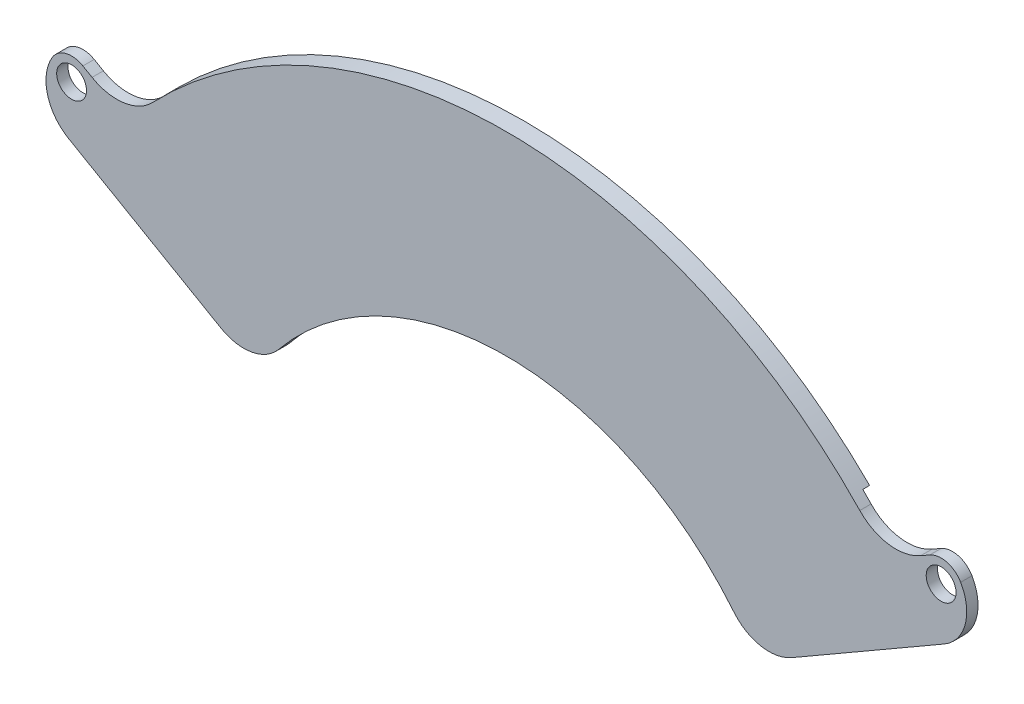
ISO-10303-21;
HEADER;
FILE_DESCRIPTION(('STEP AP214'),'2;1');
FILE_NAME('part.step','',(''),(''),'','','');
FILE_SCHEMA(('AUTOMOTIVE_DESIGN { 1 0 10303 214 1 1 1 1 }'));
ENDSEC;
DATA;
#1=APPLICATION_CONTEXT('core data for automotive mechanical design processes');
#2=APPLICATION_PROTOCOL_DEFINITION('international standard','automotive_design',2000,#1);
#3=PRODUCT_CONTEXT('',#1,'mechanical');
#4=PRODUCT('Part','Part','',(#3));
#5=PRODUCT_RELATED_PRODUCT_CATEGORY('part','',(#4));
#6=PRODUCT_DEFINITION_FORMATION('','',#4);
#7=PRODUCT_DEFINITION_CONTEXT('part definition',#1,'design');
#8=PRODUCT_DEFINITION('design','',#6,#7);
#9=PRODUCT_DEFINITION_SHAPE('','',#8);
#10=(LENGTH_UNIT() NAMED_UNIT(*) SI_UNIT(.MILLI.,.METRE.));
#11=(NAMED_UNIT(*) PLANE_ANGLE_UNIT() SI_UNIT($,.RADIAN.));
#12=(NAMED_UNIT(*) SI_UNIT($,.STERADIAN.) SOLID_ANGLE_UNIT());
#13=UNCERTAINTY_MEASURE_WITH_UNIT(LENGTH_MEASURE(1.E-05),#10,'distance_accuracy_value','');
#14=(GEOMETRIC_REPRESENTATION_CONTEXT(3) GLOBAL_UNCERTAINTY_ASSIGNED_CONTEXT((#13)) GLOBAL_UNIT_ASSIGNED_CONTEXT((#10,
#11,#12)) REPRESENTATION_CONTEXT('',''));
#15=CARTESIAN_POINT('',(0.,0.,0.));
#16=DIRECTION('',(0.,0.,1.));
#17=DIRECTION('',(1.,0.,0.));
#18=AXIS2_PLACEMENT_3D('',#15,#16,#17);
#19=CARTESIAN_POINT('',(105.521124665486,63.232050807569,-3.));
#20=DIRECTION('',(-0.5,0.866025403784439,0.));
#21=DIRECTION('',(-0.866025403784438,-0.5,0.));
#22=AXIS2_PLACEMENT_3D('',#19,#20,#21);
#23=PLANE('',#22);
#24=DIRECTION('',(-0.866025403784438,-0.5,0.));
#25=VECTOR('',#24,1.);
#26=CARTESIAN_POINT('',(105.521124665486,63.232050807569,1.));
#27=LINE('',#26,#25);
#28=CARTESIAN_POINT('',(96.8608706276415,58.232050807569,1.));
#29=VERTEX_POINT('',#28);
#30=CARTESIAN_POINT('',(63.1151308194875,38.7489388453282,1.));
#31=VERTEX_POINT('',#30);
#32=EDGE_CURVE('E209',#29,#31,#27,.T.);
#33=ORIENTED_EDGE('',*,*,#32,.T.);
#34=DIRECTION('',(0.,0.,1.));
#35=VECTOR('',#34,1.);
#36=CARTESIAN_POINT('',(63.1151308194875,38.7489388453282,-3.));
#37=LINE('',#36,#35);
#38=CARTESIAN_POINT('',(63.1151308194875,38.7489388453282,-1.5));
#39=VERTEX_POINT('',#38);
#40=EDGE_CURVE('E42',#31,#39,#37,.F.);
#41=ORIENTED_EDGE('',*,*,#40,.T.);
#42=DIRECTION('',(-0.866025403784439,-0.5,0.));
#43=VECTOR('',#42,1.);
#44=CARTESIAN_POINT('',(105.521124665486,63.232050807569,-1.5));
#45=LINE('',#44,#43);
#46=CARTESIAN_POINT('',(96.8608706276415,58.232050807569,-1.5));
#47=VERTEX_POINT('',#46);
#48=EDGE_CURVE('E243',#47,#39,#45,.T.);
#49=ORIENTED_EDGE('',*,*,#48,.F.);
#50=DIRECTION('',(0.,0.,1.));
#51=VECTOR('',#50,1.);
#52=CARTESIAN_POINT('',(96.8608706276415,58.232050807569,-3.));
#53=LINE('',#52,#51);
#54=EDGE_CURVE('E238',#47,#29,#53,.T.);
#55=ORIENTED_EDGE('',*,*,#54,.T.);
#56=EDGE_LOOP('',(#33,#41,#49,#55));
#57=FACE_BOUND('',#56,.T.);
#58=ADVANCED_FACE('F28',(#57),#23,.F.);
#59=CARTESIAN_POINT('',(0.,0.,-3.));
#60=DIRECTION('',(0.,0.,1.));
#61=DIRECTION('',(1.,0.,0.));
#62=AXIS2_PLACEMENT_3D('',#59,#60,#61);
#63=CYLINDRICAL_SURFACE('',#62,65.);
#64=CARTESIAN_POINT('',(0.,0.,1.));
#65=DIRECTION('',(0.,0.,1.));
#66=DIRECTION('',(-1.,0.,0.));
#67=AXIS2_PLACEMENT_3D('',#64,#65,#66);
#68=CIRCLE('',#67,65.);
#69=CARTESIAN_POINT('',(50.3664467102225,41.0879671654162,1.));
#70=VERTEX_POINT('',#69);
#71=CARTESIAN_POINT('',(-50.3664467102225,41.0879671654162,1.));
#72=VERTEX_POINT('',#71);
#73=EDGE_CURVE('E250',#70,#72,#68,.T.);
#74=ORIENTED_EDGE('',*,*,#73,.T.);
#75=DIRECTION('',(0.,0.,1.));
#76=VECTOR('',#75,1.);
#77=CARTESIAN_POINT('',(-50.3664467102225,41.0879671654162,-3.));
#78=LINE('',#77,#76);
#79=CARTESIAN_POINT('',(-50.3664467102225,41.0879671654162,-1.5));
#80=VERTEX_POINT('',#79);
#81=EDGE_CURVE('E236',#72,#80,#78,.F.);
#82=ORIENTED_EDGE('',*,*,#81,.T.);
#83=CARTESIAN_POINT('',(0.,0.,-1.5));
#84=DIRECTION('',(0.,0.,-1.));
#85=DIRECTION('',(-1.,0.,0.));
#86=AXIS2_PLACEMENT_3D('',#83,#84,#85);
#87=CIRCLE('',#86,65.);
#88=CARTESIAN_POINT('',(-45.9619407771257,45.9619407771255,-1.5));
#89=VERTEX_POINT('',#88);
#90=EDGE_CURVE('E173',#89,#80,#87,.F.);
#91=ORIENTED_EDGE('',*,*,#90,.F.);
#92=DIRECTION('',(0.,0.,-1.));
#93=VECTOR('',#92,1.);
#94=CARTESIAN_POINT('',(-45.9619407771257,45.9619407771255,-1.5));
#95=LINE('',#94,#93);
#96=CARTESIAN_POINT('',(-45.9619407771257,45.9619407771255,-3.));
#97=VERTEX_POINT('',#96);
#98=EDGE_CURVE('E154',#89,#97,#95,.T.);
#99=ORIENTED_EDGE('',*,*,#98,.T.);
#100=CARTESIAN_POINT('',(0.,0.,-3.));
#101=DIRECTION('',(0.,0.,1.));
#102=DIRECTION('',(-1.,0.,0.));
#103=AXIS2_PLACEMENT_3D('',#100,#101,#102);
#104=CIRCLE('',#103,65.);
#105=CARTESIAN_POINT('',(45.9619407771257,45.9619407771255,-3.));
#106=VERTEX_POINT('',#105);
#107=EDGE_CURVE('E171',#106,#97,#104,.T.);
#108=ORIENTED_EDGE('',*,*,#107,.F.);
#109=DIRECTION('',(0.,0.,-1.));
#110=VECTOR('',#109,1.);
#111=CARTESIAN_POINT('',(45.9619407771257,45.9619407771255,-1.5));
#112=LINE('',#111,#110);
#113=CARTESIAN_POINT('',(45.9619407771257,45.9619407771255,-1.5));
#114=VERTEX_POINT('',#113);
#115=EDGE_CURVE('E174',#114,#106,#112,.T.);
#116=ORIENTED_EDGE('',*,*,#115,.F.);
#117=CARTESIAN_POINT('',(50.3664467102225,41.0879671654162,-1.5));
#118=VERTEX_POINT('',#117);
#119=EDGE_CURVE('E374',#118,#114,#87,.F.);
#120=ORIENTED_EDGE('',*,*,#119,.F.);
#121=DIRECTION('',(0.,0.,1.));
#122=VECTOR('',#121,1.);
#123=CARTESIAN_POINT('',(50.3664467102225,41.0879671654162,-3.));
#124=LINE('',#123,#122);
#125=EDGE_CURVE('E233',#118,#70,#124,.T.);
#126=ORIENTED_EDGE('',*,*,#125,.T.);
#127=EDGE_LOOP('',(#74,#82,#91,#99,#108,#116,#120,#126));
#128=FACE_BOUND('',#127,.T.);
#129=ADVANCED_FACE('F169',(#128),#63,.F.);
#130=CARTESIAN_POINT('',(-55.2649980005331,34.2166625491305,-3.));
#131=DIRECTION('',(0.5,0.866025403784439,0.));
#132=DIRECTION('',(-0.866025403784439,0.5,0.));
#133=AXIS2_PLACEMENT_3D('',#130,#131,#132);
#134=PLANE('',#133);
#135=DIRECTION('',(-0.866025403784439,0.5,0.));
#136=VECTOR('',#135,1.);
#137=CARTESIAN_POINT('',(-55.2649980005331,34.2166625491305,1.));
#138=LINE('',#137,#136);
#139=CARTESIAN_POINT('',(-63.1151308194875,38.7489388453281,1.));
#140=VERTEX_POINT('',#139);
#141=CARTESIAN_POINT('',(-96.8608706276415,58.2320508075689,1.));
#142=VERTEX_POINT('',#141);
#143=EDGE_CURVE('E252',#140,#142,#138,.T.);
#144=ORIENTED_EDGE('',*,*,#143,.T.);
#145=DIRECTION('',(0.,0.,1.));
#146=VECTOR('',#145,1.);
#147=CARTESIAN_POINT('',(-96.8608706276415,58.2320508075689,-3.));
#148=LINE('',#147,#146);
#149=CARTESIAN_POINT('',(-96.8608706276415,58.2320508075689,-1.5));
#150=VERTEX_POINT('',#149);
#151=EDGE_CURVE('E227',#142,#150,#148,.F.);
#152=ORIENTED_EDGE('',*,*,#151,.T.);
#153=DIRECTION('',(-0.866025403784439,0.5,0.));
#154=VECTOR('',#153,1.);
#155=CARTESIAN_POINT('',(-55.2649980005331,34.2166625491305,-1.5));
#156=LINE('',#155,#154);
#157=CARTESIAN_POINT('',(-63.1151308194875,38.7489388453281,-1.5));
#158=VERTEX_POINT('',#157);
#159=EDGE_CURVE('E255',#158,#150,#156,.T.);
#160=ORIENTED_EDGE('',*,*,#159,.F.);
#161=DIRECTION('',(0.,0.,1.));
#162=VECTOR('',#161,1.);
#163=CARTESIAN_POINT('',(-63.1151308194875,38.7489388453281,-3.));
#164=LINE('',#163,#162);
#165=EDGE_CURVE('E224',#158,#140,#164,.T.);
#166=ORIENTED_EDGE('',*,*,#165,.T.);
#167=EDGE_LOOP('',(#144,#152,#160,#166));
#168=FACE_BOUND('',#167,.T.);
#169=ADVANCED_FACE('F301',(#168),#134,.F.);
#170=CARTESIAN_POINT('',(-96.1909976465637,69.3923048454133,-3.));
#171=DIRECTION('',(0.,0.,1.));
#172=DIRECTION('',(1.,0.,0.));
#173=AXIS2_PLACEMENT_3D('',#170,#171,#172);
#174=CYLINDRICAL_SURFACE('',#173,4.99999999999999);
#175=CARTESIAN_POINT('',(-96.1909976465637,69.3923048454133,-1.5));
#176=DIRECTION('',(0.,0.,-1.));
#177=DIRECTION('',(-1.,0.,0.));
#178=AXIS2_PLACEMENT_3D('',#175,#176,#177);
#179=CIRCLE('',#178,4.99999999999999);
#180=CARTESIAN_POINT('',(-100.521124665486,71.8923048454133,-1.5));
#181=VERTEX_POINT('',#180);
#182=CARTESIAN_POINT('',(-93.6909976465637,73.7224318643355,-1.5));
#183=VERTEX_POINT('',#182);
#184=EDGE_CURVE('E372',#181,#183,#179,.T.);
#185=ORIENTED_EDGE('',*,*,#184,.F.);
#186=DIRECTION('',(0.,0.,1.));
#187=VECTOR('',#186,1.);
#188=CARTESIAN_POINT('',(-100.521124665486,71.8923048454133,-3.));
#189=LINE('',#188,#187);
#190=CARTESIAN_POINT('',(-100.521124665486,71.8923048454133,1.));
#191=VERTEX_POINT('',#190);
#192=EDGE_CURVE('E202',#181,#191,#189,.T.);
#193=ORIENTED_EDGE('',*,*,#192,.T.);
#194=CARTESIAN_POINT('',(-96.1909976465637,69.3923048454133,1.));
#195=DIRECTION('',(0.,0.,-1.));
#196=DIRECTION('',(-1.,0.,0.));
#197=AXIS2_PLACEMENT_3D('',#194,#195,#196);
#198=CIRCLE('',#197,4.99999999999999);
#199=CARTESIAN_POINT('',(-93.6909976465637,73.7224318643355,1.));
#200=VERTEX_POINT('',#199);
#201=EDGE_CURVE('E260',#191,#200,#198,.T.);
#202=ORIENTED_EDGE('',*,*,#201,.T.);
#203=DIRECTION('',(0.,0.,1.));
#204=VECTOR('',#203,1.);
#205=CARTESIAN_POINT('',(-93.6909976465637,73.7224318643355,-3.));
#206=LINE('',#205,#204);
#207=EDGE_CURVE('E200',#183,#200,#206,.T.);
#208=ORIENTED_EDGE('',*,*,#207,.F.);
#209=EDGE_LOOP('',(#185,#193,#202,#208));
#210=FACE_BOUND('',#209,.T.);
#211=ADVANCED_FACE('F305',(#210),#174,.T.);
#212=CARTESIAN_POINT('',(-93.6909976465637,73.7224318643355,-3.));
#213=DIRECTION('',(-0.499999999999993,-0.866025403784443,0.));
#214=DIRECTION('',(0.866025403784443,-0.499999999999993,0.));
#215=AXIS2_PLACEMENT_3D('',#212,#213,#214);
#216=PLANE('',#215);
#217=DIRECTION('',(0.866025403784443,-0.499999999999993,0.));
#218=VECTOR('',#217,1.);
#219=CARTESIAN_POINT('',(-93.6909976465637,73.7224318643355,-1.5));
#220=LINE('',#219,#218);
#221=CARTESIAN_POINT('',(-91.6636161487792,72.5519226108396,-1.5));
#222=VERTEX_POINT('',#221);
#223=EDGE_CURVE('E375',#183,#222,#220,.T.);
#224=ORIENTED_EDGE('',*,*,#223,.F.);
#225=ORIENTED_EDGE('',*,*,#207,.T.);
#226=DIRECTION('',(0.866025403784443,-0.499999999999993,0.));
#227=VECTOR('',#226,1.);
#228=CARTESIAN_POINT('',(-93.6909976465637,73.7224318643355,1.));
#229=LINE('',#228,#227);
#230=CARTESIAN_POINT('',(-91.6636161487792,72.5519226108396,1.));
#231=VERTEX_POINT('',#230);
#232=EDGE_CURVE('E263',#200,#231,#229,.T.);
#233=ORIENTED_EDGE('',*,*,#232,.T.);
#234=DIRECTION('',(0.,0.,1.));
#235=VECTOR('',#234,1.);
#236=CARTESIAN_POINT('',(-91.6636161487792,72.5519226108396,-3.));
#237=LINE('',#236,#235);
#238=EDGE_CURVE('E198',#222,#231,#237,.T.);
#239=ORIENTED_EDGE('',*,*,#238,.F.);
#240=EDGE_LOOP('',(#224,#225,#233,#239));
#241=FACE_BOUND('',#240,.T.);
#242=ADVANCED_FACE('F311',(#241),#216,.F.);
#243=CARTESIAN_POINT('',(-86.1636161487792,82.0782020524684,-3.));
#244=DIRECTION('',(0.,0.,1.));
#245=DIRECTION('',(1.,0.,0.));
#246=AXIS2_PLACEMENT_3D('',#243,#244,#245);
#247=CYLINDRICAL_SURFACE('',#246,11.);
#248=CARTESIAN_POINT('',(-86.1636161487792,82.0782020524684,-1.5));
#249=DIRECTION('',(0.,0.,-1.));
#250=DIRECTION('',(-1.,0.,0.));
#251=AXIS2_PLACEMENT_3D('',#248,#249,#250);
#252=CIRCLE('',#251,11.);
#253=CARTESIAN_POINT('',(-78.1989121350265,74.4911413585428,-1.5));
#254=VERTEX_POINT('',#253);
#255=EDGE_CURVE('E378',#222,#254,#252,.F.);
#256=ORIENTED_EDGE('',*,*,#255,.F.);
#257=ORIENTED_EDGE('',*,*,#238,.T.);
#258=CARTESIAN_POINT('',(-86.1636161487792,82.0782020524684,1.));
#259=DIRECTION('',(0.,0.,1.));
#260=DIRECTION('',(-1.,0.,0.));
#261=AXIS2_PLACEMENT_3D('',#258,#259,#260);
#262=CIRCLE('',#261,11.);
#263=CARTESIAN_POINT('',(-78.1989121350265,74.4911413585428,1.));
#264=VERTEX_POINT('',#263);
#265=EDGE_CURVE('E266',#231,#264,#262,.T.);
#266=ORIENTED_EDGE('',*,*,#265,.T.);
#267=DIRECTION('',(0.,0.,1.));
#268=VECTOR('',#267,1.);
#269=CARTESIAN_POINT('',(-78.1989121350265,74.4911413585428,-3.));
#270=LINE('',#269,#268);
#271=EDGE_CURVE('E196',#254,#264,#270,.T.);
#272=ORIENTED_EDGE('',*,*,#271,.F.);
#273=EDGE_LOOP('',(#256,#257,#266,#272));
#274=FACE_BOUND('',#273,.T.);
#275=ADVANCED_FACE('F315',(#274),#247,.F.);
#276=CARTESIAN_POINT('',(0.,0.,-3.));
#277=DIRECTION('',(0.,0.,1.));
#278=DIRECTION('',(1.,0.,0.));
#279=AXIS2_PLACEMENT_3D('',#276,#277,#278);
#280=CYLINDRICAL_SURFACE('',#279,108.);
#281=DIRECTION('',(0.,0.,-1.));
#282=VECTOR('',#281,1.);
#283=CARTESIAN_POINT('',(-76.3675323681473,76.367532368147,-1.5));
#284=LINE('',#283,#282);
#285=CARTESIAN_POINT('',(-76.3675323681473,76.367532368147,-1.5));
#286=VERTEX_POINT('',#285);
#287=CARTESIAN_POINT('',(-76.3675323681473,76.367532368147,-3.));
#288=VERTEX_POINT('',#287);
#289=EDGE_CURVE('E157',#286,#288,#284,.T.);
#290=ORIENTED_EDGE('',*,*,#289,.F.);
#291=CARTESIAN_POINT('',(0.,0.,-1.5));
#292=DIRECTION('',(0.,0.,-1.));
#293=DIRECTION('',(-1.,0.,0.));
#294=AXIS2_PLACEMENT_3D('',#291,#292,#293);
#295=CIRCLE('',#294,108.);
#296=EDGE_CURVE('E381',#254,#286,#295,.T.);
#297=ORIENTED_EDGE('',*,*,#296,.F.);
#298=ORIENTED_EDGE('',*,*,#271,.T.);
#299=CARTESIAN_POINT('',(0.,0.,1.));
#300=DIRECTION('',(0.,0.,-1.));
#301=DIRECTION('',(-1.,0.,0.));
#302=AXIS2_PLACEMENT_3D('',#299,#300,#301);
#303=CIRCLE('',#302,108.);
#304=CARTESIAN_POINT('',(78.1989121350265,74.4911413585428,1.));
#305=VERTEX_POINT('',#304);
#306=EDGE_CURVE('E269',#264,#305,#303,.T.);
#307=ORIENTED_EDGE('',*,*,#306,.T.);
#308=DIRECTION('',(0.,0.,1.));
#309=VECTOR('',#308,1.);
#310=CARTESIAN_POINT('',(78.1989121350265,74.4911413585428,-3.));
#311=LINE('',#310,#309);
#312=CARTESIAN_POINT('',(78.1989121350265,74.4911413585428,-1.5));
#313=VERTEX_POINT('',#312);
#314=EDGE_CURVE('E194',#313,#305,#311,.T.);
#315=ORIENTED_EDGE('',*,*,#314,.F.);
#316=CARTESIAN_POINT('',(76.3675323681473,76.367532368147,-1.5));
#317=VERTEX_POINT('',#316);
#318=EDGE_CURVE('E384',#317,#313,#295,.T.);
#319=ORIENTED_EDGE('',*,*,#318,.F.);
#320=DIRECTION('',(0.,0.,-1.));
#321=VECTOR('',#320,1.);
#322=CARTESIAN_POINT('',(76.3675323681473,76.367532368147,-1.5));
#323=LINE('',#322,#321);
#324=CARTESIAN_POINT('',(76.3675323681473,76.367532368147,-3.));
#325=VERTEX_POINT('',#324);
#326=EDGE_CURVE('E394',#317,#325,#323,.T.);
#327=ORIENTED_EDGE('',*,*,#326,.T.);
#328=CARTESIAN_POINT('',(0.,0.,-3.));
#329=DIRECTION('',(0.,0.,-1.));
#330=DIRECTION('',(-1.,0.,0.));
#331=AXIS2_PLACEMENT_3D('',#328,#329,#330);
#332=CIRCLE('',#331,108.);
#333=EDGE_CURVE('E178',#288,#325,#332,.T.);
#334=ORIENTED_EDGE('',*,*,#333,.F.);
#335=EDGE_LOOP('',(#290,#297,#298,#307,#315,#319,#327,#334));
#336=FACE_BOUND('',#335,.T.);
#337=ADVANCED_FACE('F319',(#336),#280,.T.);
#338=CARTESIAN_POINT('',(86.1636161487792,82.0782020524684,-3.));
#339=DIRECTION('',(0.,0.,1.));
#340=DIRECTION('',(1.,0.,0.));
#341=AXIS2_PLACEMENT_3D('',#338,#339,#340);
#342=CYLINDRICAL_SURFACE('',#341,11.);
#343=CARTESIAN_POINT('',(86.1636161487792,82.0782020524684,-1.5));
#344=DIRECTION('',(0.,0.,-1.));
#345=DIRECTION('',(-1.,0.,0.));
#346=AXIS2_PLACEMENT_3D('',#343,#344,#345);
#347=CIRCLE('',#346,11.);
#348=CARTESIAN_POINT('',(91.6636161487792,72.5519226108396,-1.5));
#349=VERTEX_POINT('',#348);
#350=EDGE_CURVE('E386',#313,#349,#347,.F.);
#351=ORIENTED_EDGE('',*,*,#350,.F.);
#352=ORIENTED_EDGE('',*,*,#314,.T.);
#353=CARTESIAN_POINT('',(86.1636161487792,82.0782020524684,1.));
#354=DIRECTION('',(0.,0.,1.));
#355=DIRECTION('',(-1.,0.,0.));
#356=AXIS2_PLACEMENT_3D('',#353,#354,#355);
#357=CIRCLE('',#356,11.);
#358=CARTESIAN_POINT('',(91.6636161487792,72.5519226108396,1.));
#359=VERTEX_POINT('',#358);
#360=EDGE_CURVE('E272',#305,#359,#357,.T.);
#361=ORIENTED_EDGE('',*,*,#360,.T.);
#362=DIRECTION('',(0.,0.,1.));
#363=VECTOR('',#362,1.);
#364=CARTESIAN_POINT('',(91.6636161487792,72.5519226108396,-3.));
#365=LINE('',#364,#363);
#366=EDGE_CURVE('E192',#349,#359,#365,.T.);
#367=ORIENTED_EDGE('',*,*,#366,.F.);
#368=EDGE_LOOP('',(#351,#352,#361,#367));
#369=FACE_BOUND('',#368,.T.);
#370=ADVANCED_FACE('F323',(#369),#342,.F.);
#371=CARTESIAN_POINT('',(91.6636161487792,72.5519226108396,-3.));
#372=DIRECTION('',(0.500000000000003,-0.866025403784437,0.));
#373=DIRECTION('',(0.866025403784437,0.500000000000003,0.));
#374=AXIS2_PLACEMENT_3D('',#371,#372,#373);
#375=PLANE('',#374);
#376=DIRECTION('',(0.866025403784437,0.500000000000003,0.));
#377=VECTOR('',#376,1.);
#378=CARTESIAN_POINT('',(91.6636161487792,72.5519226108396,-1.5));
#379=LINE('',#378,#377);
#380=CARTESIAN_POINT('',(93.6909976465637,73.7224318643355,-1.5));
#381=VERTEX_POINT('',#380);
#382=EDGE_CURVE('E388',#349,#381,#379,.T.);
#383=ORIENTED_EDGE('',*,*,#382,.F.);
#384=ORIENTED_EDGE('',*,*,#366,.T.);
#385=DIRECTION('',(0.866025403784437,0.500000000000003,0.));
#386=VECTOR('',#385,1.);
#387=CARTESIAN_POINT('',(91.6636161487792,72.5519226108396,1.));
#388=LINE('',#387,#386);
#389=CARTESIAN_POINT('',(93.6909976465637,73.7224318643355,1.));
#390=VERTEX_POINT('',#389);
#391=EDGE_CURVE('E184',#359,#390,#388,.T.);
#392=ORIENTED_EDGE('',*,*,#391,.T.);
#393=DIRECTION('',(0.,0.,1.));
#394=VECTOR('',#393,1.);
#395=CARTESIAN_POINT('',(93.6909976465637,73.7224318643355,-3.));
#396=LINE('',#395,#394);
#397=EDGE_CURVE('E190',#381,#390,#396,.T.);
#398=ORIENTED_EDGE('',*,*,#397,.F.);
#399=EDGE_LOOP('',(#383,#384,#392,#398));
#400=FACE_BOUND('',#399,.T.);
#401=ADVANCED_FACE('F279',(#400),#375,.F.);
#402=CARTESIAN_POINT('',(96.1909976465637,69.3923048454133,-3.));
#403=DIRECTION('',(0.,0.,1.));
#404=DIRECTION('',(1.,0.,0.));
#405=AXIS2_PLACEMENT_3D('',#402,#403,#404);
#406=CYLINDRICAL_SURFACE('',#405,5.);
#407=CARTESIAN_POINT('',(96.1909976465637,69.3923048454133,-1.5));
#408=DIRECTION('',(0.,0.,-1.));
#409=DIRECTION('',(-1.,0.,0.));
#410=AXIS2_PLACEMENT_3D('',#407,#408,#409);
#411=CIRCLE('',#410,5.);
#412=CARTESIAN_POINT('',(100.521124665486,71.8923048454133,-1.5));
#413=VERTEX_POINT('',#412);
#414=EDGE_CURVE('E390',#381,#413,#411,.T.);
#415=ORIENTED_EDGE('',*,*,#414,.F.);
#416=ORIENTED_EDGE('',*,*,#397,.T.);
#417=CARTESIAN_POINT('',(96.1909976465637,69.3923048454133,1.));
#418=DIRECTION('',(0.,0.,-1.));
#419=DIRECTION('',(-1.,0.,0.));
#420=AXIS2_PLACEMENT_3D('',#417,#418,#419);
#421=CIRCLE('',#420,5.);
#422=CARTESIAN_POINT('',(100.521124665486,71.8923048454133,1.));
#423=VERTEX_POINT('',#422);
#424=EDGE_CURVE('E179',#390,#423,#421,.T.);
#425=ORIENTED_EDGE('',*,*,#424,.T.);
#426=DIRECTION('',(0.,0.,1.));
#427=VECTOR('',#426,1.);
#428=CARTESIAN_POINT('',(100.521124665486,71.8923048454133,-3.));
#429=LINE('',#428,#427);
#430=EDGE_CURVE('E181',#413,#423,#429,.T.);
#431=ORIENTED_EDGE('',*,*,#430,.F.);
#432=EDGE_LOOP('',(#415,#416,#425,#431));
#433=FACE_BOUND('',#432,.T.);
#434=ADVANCED_FACE('F285',(#433),#406,.T.);
#435=CARTESIAN_POINT('',(0.,0.,-3.));
#436=DIRECTION('',(0.,0.,-1.));
#437=DIRECTION('',(-1.,0.,0.));
#438=AXIS2_PLACEMENT_3D('',#435,#436,#437);
#439=PLANE('',#438);
#440=ORIENTED_EDGE('',*,*,#107,.T.);
#441=DIRECTION('',(-0.707106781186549,0.707106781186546,0.));
#442=VECTOR('',#441,1.);
#443=CARTESIAN_POINT('',(-45.9619407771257,45.9619407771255,-3.));
#444=LINE('',#443,#442);
#445=EDGE_CURVE('E150',#97,#288,#444,.T.);
#446=ORIENTED_EDGE('',*,*,#445,.T.);
#447=ORIENTED_EDGE('',*,*,#333,.T.);
#448=DIRECTION('',(-0.707106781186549,-0.707106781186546,0.));
#449=VECTOR('',#448,1.);
#450=CARTESIAN_POINT('',(45.9619407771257,45.9619407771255,-3.));
#451=LINE('',#450,#449);
#452=EDGE_CURVE('E163',#325,#106,#451,.T.);
#453=ORIENTED_EDGE('',*,*,#452,.T.);
#454=EDGE_LOOP('',(#440,#446,#447,#453));
#455=FACE_BOUND('',#454,.T.);
#456=ADVANCED_FACE('F177',(#455),#439,.T.);
#457=CARTESIAN_POINT('',(96.1909976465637,69.3923048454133,-3.));
#458=DIRECTION('',(0.,0.,-1.));
#459=DIRECTION('',(-1.,0.,0.));
#460=AXIS2_PLACEMENT_3D('',#457,#458,#459);
#461=CYLINDRICAL_SURFACE('',#460,3.29999999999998);
#462=CARTESIAN_POINT('',(96.1909976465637,69.3923048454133,1.));
#463=DIRECTION('',(0.,0.,-1.));
#464=DIRECTION('',(-1.,0.,0.));
#465=AXIS2_PLACEMENT_3D('',#462,#463,#464);
#466=CIRCLE('',#465,3.29999999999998);
#467=CARTESIAN_POINT('',(92.8909976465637,69.3923048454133,1.));
#468=VERTEX_POINT('',#467);
#469=EDGE_CURVE('E206',#468,#468,#466,.T.);
#470=ORIENTED_EDGE('',*,*,#469,.F.);
#471=EDGE_LOOP('',(#470));
#472=FACE_BOUND('',#471,.T.);
#473=CARTESIAN_POINT('',(96.1909976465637,69.3923048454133,-1.5));
#474=DIRECTION('',(0.,0.,-1.));
#475=DIRECTION('',(-1.,0.,0.));
#476=AXIS2_PLACEMENT_3D('',#473,#474,#475);
#477=CIRCLE('',#476,3.29999999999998);
#478=CARTESIAN_POINT('',(92.8909976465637,69.3923048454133,-1.5));
#479=VERTEX_POINT('',#478);
#480=EDGE_CURVE('E216',#479,#479,#477,.F.);
#481=ORIENTED_EDGE('',*,*,#480,.F.);
#482=EDGE_LOOP('',(#481));
#483=FACE_BOUND('',#482,.T.);
#484=ADVANCED_FACE('F334',(#472,#483),#461,.F.);
#485=CARTESIAN_POINT('',(-96.1909976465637,69.3923048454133,-3.));
#486=DIRECTION('',(0.,0.,-1.));
#487=DIRECTION('',(-1.,0.,0.));
#488=AXIS2_PLACEMENT_3D('',#485,#486,#487);
#489=CYLINDRICAL_SURFACE('',#488,3.29999999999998);
#490=CARTESIAN_POINT('',(-96.1909976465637,69.3923048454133,1.));
#491=DIRECTION('',(0.,0.,-1.));
#492=DIRECTION('',(-1.,0.,0.));
#493=AXIS2_PLACEMENT_3D('',#490,#491,#492);
#494=CIRCLE('',#493,3.29999999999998);
#495=CARTESIAN_POINT('',(-99.4909976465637,69.3923048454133,1.));
#496=VERTEX_POINT('',#495);
#497=EDGE_CURVE('E210',#496,#496,#494,.T.);
#498=ORIENTED_EDGE('',*,*,#497,.F.);
#499=EDGE_LOOP('',(#498));
#500=FACE_BOUND('',#499,.T.);
#501=CARTESIAN_POINT('',(-96.1909976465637,69.3923048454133,-1.5));
#502=DIRECTION('',(0.,0.,-1.));
#503=DIRECTION('',(-1.,0.,0.));
#504=AXIS2_PLACEMENT_3D('',#501,#502,#503);
#505=CIRCLE('',#504,3.29999999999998);
#506=CARTESIAN_POINT('',(-99.4909976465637,69.3923048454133,-1.5));
#507=VERTEX_POINT('',#506);
#508=EDGE_CURVE('E213',#507,#507,#505,.F.);
#509=ORIENTED_EDGE('',*,*,#508,.F.);
#510=EDGE_LOOP('',(#509));
#511=FACE_BOUND('',#510,.T.);
#512=ADVANCED_FACE('F338',(#500,#511),#489,.F.);
#513=CARTESIAN_POINT('',(0.,0.,1.));
#514=DIRECTION('',(0.,0.,-1.));
#515=DIRECTION('',(-1.,0.,0.));
#516=AXIS2_PLACEMENT_3D('',#513,#514,#515);
#517=PLANE('',#516);
#518=ORIENTED_EDGE('',*,*,#497,.T.);
#519=EDGE_LOOP('',(#518));
#520=FACE_BOUND('',#519,.T.);
#521=ORIENTED_EDGE('',*,*,#469,.T.);
#522=EDGE_LOOP('',(#521));
#523=FACE_BOUND('',#522,.T.);
#524=ORIENTED_EDGE('',*,*,#201,.F.);
#525=CARTESIAN_POINT('',(-91.8608706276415,66.8923048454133,1.));
#526=DIRECTION('',(0.,0.,-1.));
#527=DIRECTION('',(-1.,0.,0.));
#528=AXIS2_PLACEMENT_3D('',#525,#526,#527);
#529=CIRCLE('',#528,10.);
#530=EDGE_CURVE('E222',#191,#142,#529,.F.);
#531=ORIENTED_EDGE('',*,*,#530,.T.);
#532=ORIENTED_EDGE('',*,*,#143,.F.);
#533=CARTESIAN_POINT('',(-58.1151308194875,47.4091928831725,1.));
#534=DIRECTION('',(0.,0.,-1.));
#535=DIRECTION('',(-1.,0.,0.));
#536=AXIS2_PLACEMENT_3D('',#533,#534,#535);
#537=CIRCLE('',#536,10.);
#538=EDGE_CURVE('E220',#140,#72,#537,.F.);
#539=ORIENTED_EDGE('',*,*,#538,.T.);
#540=ORIENTED_EDGE('',*,*,#73,.F.);
#541=CARTESIAN_POINT('',(58.1151308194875,47.4091928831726,1.));
#542=DIRECTION('',(0.,0.,-1.));
#543=DIRECTION('',(-1.,0.,0.));
#544=AXIS2_PLACEMENT_3D('',#541,#542,#543);
#545=CIRCLE('',#544,10.);
#546=EDGE_CURVE('E218',#70,#31,#545,.F.);
#547=ORIENTED_EDGE('',*,*,#546,.T.);
#548=ORIENTED_EDGE('',*,*,#32,.F.);
#549=CARTESIAN_POINT('',(91.8608706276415,66.8923048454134,1.));
#550=DIRECTION('',(0.,0.,-1.));
#551=DIRECTION('',(-1.,0.,0.));
#552=AXIS2_PLACEMENT_3D('',#549,#550,#551);
#553=CIRCLE('',#552,10.);
#554=EDGE_CURVE('E205',#29,#423,#553,.F.);
#555=ORIENTED_EDGE('',*,*,#554,.T.);
#556=ORIENTED_EDGE('',*,*,#424,.F.);
#557=ORIENTED_EDGE('',*,*,#391,.F.);
#558=ORIENTED_EDGE('',*,*,#360,.F.);
#559=ORIENTED_EDGE('',*,*,#306,.F.);
#560=ORIENTED_EDGE('',*,*,#265,.F.);
#561=ORIENTED_EDGE('',*,*,#232,.F.);
#562=EDGE_LOOP('',(#524,#531,#532,#539,#540,#547,#548,#555,#556,#557,#558,#559,#560,#561));
#563=FACE_BOUND('',#562,.T.);
#564=ADVANCED_FACE('F247',(#520,#523,#563),#517,.F.);
#565=CARTESIAN_POINT('',(-1.04083408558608E-13,79.5692058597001,-1.5));
#566=DIRECTION('',(0.,0.,-1.));
#567=DIRECTION('',(-1.,0.,0.));
#568=AXIS2_PLACEMENT_3D('',#565,#566,#567);
#569=PLANE('',#568);
#570=ORIENTED_EDGE('',*,*,#508,.T.);
#571=EDGE_LOOP('',(#570));
#572=FACE_BOUND('',#571,.T.);
#573=ORIENTED_EDGE('',*,*,#159,.T.);
#574=CARTESIAN_POINT('',(-91.8608706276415,66.8923048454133,-1.5));
#575=DIRECTION('',(0.,0.,-1.));
#576=DIRECTION('',(-1.,0.,0.));
#577=AXIS2_PLACEMENT_3D('',#574,#575,#576);
#578=CIRCLE('',#577,10.);
#579=EDGE_CURVE('E231',#150,#181,#578,.T.);
#580=ORIENTED_EDGE('',*,*,#579,.T.);
#581=ORIENTED_EDGE('',*,*,#184,.T.);
#582=ORIENTED_EDGE('',*,*,#223,.T.);
#583=ORIENTED_EDGE('',*,*,#255,.T.);
#584=ORIENTED_EDGE('',*,*,#296,.T.);
#585=DIRECTION('',(-0.707106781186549,0.707106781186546,0.));
#586=VECTOR('',#585,1.);
#587=CARTESIAN_POINT('',(-45.9619407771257,45.9619407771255,-1.5));
#588=LINE('',#587,#586);
#589=EDGE_CURVE('E397',#89,#286,#588,.T.);
#590=ORIENTED_EDGE('',*,*,#589,.F.);
#591=ORIENTED_EDGE('',*,*,#90,.T.);
#592=CARTESIAN_POINT('',(-58.1151308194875,47.4091928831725,-1.5));
#593=DIRECTION('',(0.,0.,-1.));
#594=DIRECTION('',(-1.,0.,0.));
#595=AXIS2_PLACEMENT_3D('',#592,#593,#594);
#596=CIRCLE('',#595,10.);
#597=EDGE_CURVE('E229',#80,#158,#596,.T.);
#598=ORIENTED_EDGE('',*,*,#597,.T.);
#599=EDGE_LOOP('',(#573,#580,#581,#582,#583,#584,#590,#591,#598));
#600=FACE_BOUND('',#599,.T.);
#601=ADVANCED_FACE('F337',(#572,#600),#569,.T.);
#602=CARTESIAN_POINT('',(-45.9619407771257,45.9619407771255,-1.5));
#603=DIRECTION('',(-0.707106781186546,-0.707106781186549,0.));
#604=DIRECTION('',(0.707106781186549,-0.707106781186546,0.));
#605=AXIS2_PLACEMENT_3D('',#602,#603,#604);
#606=PLANE('',#605);
#607=ORIENTED_EDGE('',*,*,#445,.F.);
#608=ORIENTED_EDGE('',*,*,#98,.F.);
#609=ORIENTED_EDGE('',*,*,#589,.T.);
#610=ORIENTED_EDGE('',*,*,#289,.T.);
#611=EDGE_LOOP('',(#607,#608,#609,#610));
#612=FACE_BOUND('',#611,.T.);
#613=ADVANCED_FACE('F152',(#612),#606,.T.);
#614=ORIENTED_EDGE('',*,*,#480,.T.);
#615=EDGE_LOOP('',(#614));
#616=FACE_BOUND('',#615,.T.);
#617=ORIENTED_EDGE('',*,*,#48,.T.);
#618=CARTESIAN_POINT('',(58.1151308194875,47.4091928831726,-1.5));
#619=DIRECTION('',(0.,0.,-1.));
#620=DIRECTION('',(-1.,0.,0.));
#621=AXIS2_PLACEMENT_3D('',#618,#619,#620);
#622=CIRCLE('',#621,10.);
#623=EDGE_CURVE('E12',#39,#118,#622,.T.);
#624=ORIENTED_EDGE('',*,*,#623,.T.);
#625=ORIENTED_EDGE('',*,*,#119,.T.);
#626=DIRECTION('',(-0.707106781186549,-0.707106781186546,0.));
#627=VECTOR('',#626,1.);
#628=CARTESIAN_POINT('',(45.9619407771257,45.9619407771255,-1.5));
#629=LINE('',#628,#627);
#630=EDGE_CURVE('E162',#317,#114,#629,.T.);
#631=ORIENTED_EDGE('',*,*,#630,.F.);
#632=ORIENTED_EDGE('',*,*,#318,.T.);
#633=ORIENTED_EDGE('',*,*,#350,.T.);
#634=ORIENTED_EDGE('',*,*,#382,.T.);
#635=ORIENTED_EDGE('',*,*,#414,.T.);
#636=CARTESIAN_POINT('',(91.8608706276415,66.8923048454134,-1.5));
#637=DIRECTION('',(0.,0.,-1.));
#638=DIRECTION('',(-1.,0.,0.));
#639=AXIS2_PLACEMENT_3D('',#636,#637,#638);
#640=CIRCLE('',#639,10.);
#641=EDGE_CURVE('E35',#413,#47,#640,.T.);
#642=ORIENTED_EDGE('',*,*,#641,.T.);
#643=EDGE_LOOP('',(#617,#624,#625,#631,#632,#633,#634,#635,#642));
#644=FACE_BOUND('',#643,.T.);
#645=ADVANCED_FACE('F349',(#616,#644),#569,.T.);
#646=CARTESIAN_POINT('',(45.9619407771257,45.9619407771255,-1.5));
#647=DIRECTION('',(0.707106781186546,-0.707106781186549,0.));
#648=DIRECTION('',(0.707106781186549,0.707106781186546,0.));
#649=AXIS2_PLACEMENT_3D('',#646,#647,#648);
#650=PLANE('',#649);
#651=ORIENTED_EDGE('',*,*,#452,.F.);
#652=ORIENTED_EDGE('',*,*,#326,.F.);
#653=ORIENTED_EDGE('',*,*,#630,.T.);
#654=ORIENTED_EDGE('',*,*,#115,.T.);
#655=EDGE_LOOP('',(#651,#652,#653,#654));
#656=FACE_BOUND('',#655,.T.);
#657=ADVANCED_FACE('F350',(#656),#650,.T.);
#658=CARTESIAN_POINT('',(-91.8608706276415,66.8923048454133,-3.));
#659=DIRECTION('',(0.,0.,1.));
#660=DIRECTION('',(1.,0.,0.));
#661=AXIS2_PLACEMENT_3D('',#658,#659,#660);
#662=CYLINDRICAL_SURFACE('',#661,10.);
#663=ORIENTED_EDGE('',*,*,#579,.F.);
#664=ORIENTED_EDGE('',*,*,#151,.F.);
#665=ORIENTED_EDGE('',*,*,#530,.F.);
#666=ORIENTED_EDGE('',*,*,#192,.F.);
#667=EDGE_LOOP('',(#663,#664,#665,#666));
#668=FACE_BOUND('',#667,.T.);
#669=ADVANCED_FACE('F352',(#668),#662,.T.);
#670=CARTESIAN_POINT('',(-58.1151308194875,47.4091928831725,-3.));
#671=DIRECTION('',(0.,0.,1.));
#672=DIRECTION('',(1.,0.,0.));
#673=AXIS2_PLACEMENT_3D('',#670,#671,#672);
#674=CYLINDRICAL_SURFACE('',#673,10.);
#675=ORIENTED_EDGE('',*,*,#597,.F.);
#676=ORIENTED_EDGE('',*,*,#81,.F.);
#677=ORIENTED_EDGE('',*,*,#538,.F.);
#678=ORIENTED_EDGE('',*,*,#165,.F.);
#679=EDGE_LOOP('',(#675,#676,#677,#678));
#680=FACE_BOUND('',#679,.T.);
#681=ADVANCED_FACE('F293',(#680),#674,.T.);
#682=CARTESIAN_POINT('',(58.1151308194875,47.4091928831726,-3.));
#683=DIRECTION('',(0.,0.,1.));
#684=DIRECTION('',(1.,0.,0.));
#685=AXIS2_PLACEMENT_3D('',#682,#683,#684);
#686=CYLINDRICAL_SURFACE('',#685,10.);
#687=ORIENTED_EDGE('',*,*,#623,.F.);
#688=ORIENTED_EDGE('',*,*,#40,.F.);
#689=ORIENTED_EDGE('',*,*,#546,.F.);
#690=ORIENTED_EDGE('',*,*,#125,.F.);
#691=EDGE_LOOP('',(#687,#688,#689,#690));
#692=FACE_BOUND('',#691,.T.);
#693=ADVANCED_FACE('F288',(#692),#686,.T.);
#694=CARTESIAN_POINT('',(91.8608706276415,66.8923048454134,-3.));
#695=DIRECTION('',(0.,0.,1.));
#696=DIRECTION('',(1.,0.,0.));
#697=AXIS2_PLACEMENT_3D('',#694,#695,#696);
#698=CYLINDRICAL_SURFACE('',#697,10.);
#699=ORIENTED_EDGE('',*,*,#641,.F.);
#700=ORIENTED_EDGE('',*,*,#430,.T.);
#701=ORIENTED_EDGE('',*,*,#554,.F.);
#702=ORIENTED_EDGE('',*,*,#54,.F.);
#703=EDGE_LOOP('',(#699,#700,#701,#702));
#704=FACE_BOUND('',#703,.T.);
#705=ADVANCED_FACE('F286',(#704),#698,.T.);
#706=CLOSED_SHELL('',(#58,#129,#169,#211,#242,#275,#337,#370,#401,#434,#456,#484,#512,#564,#601,
#613,#645,#657,#669,#681,#693,#705));
#707=MANIFOLD_SOLID_BREP('B2',#706);
#708=ADVANCED_BREP_SHAPE_REPRESENTATION('',(#18,#707),#14);
#709=SHAPE_DEFINITION_REPRESENTATION(#9,#708);
ENDSEC;
END-ISO-10303-21;
